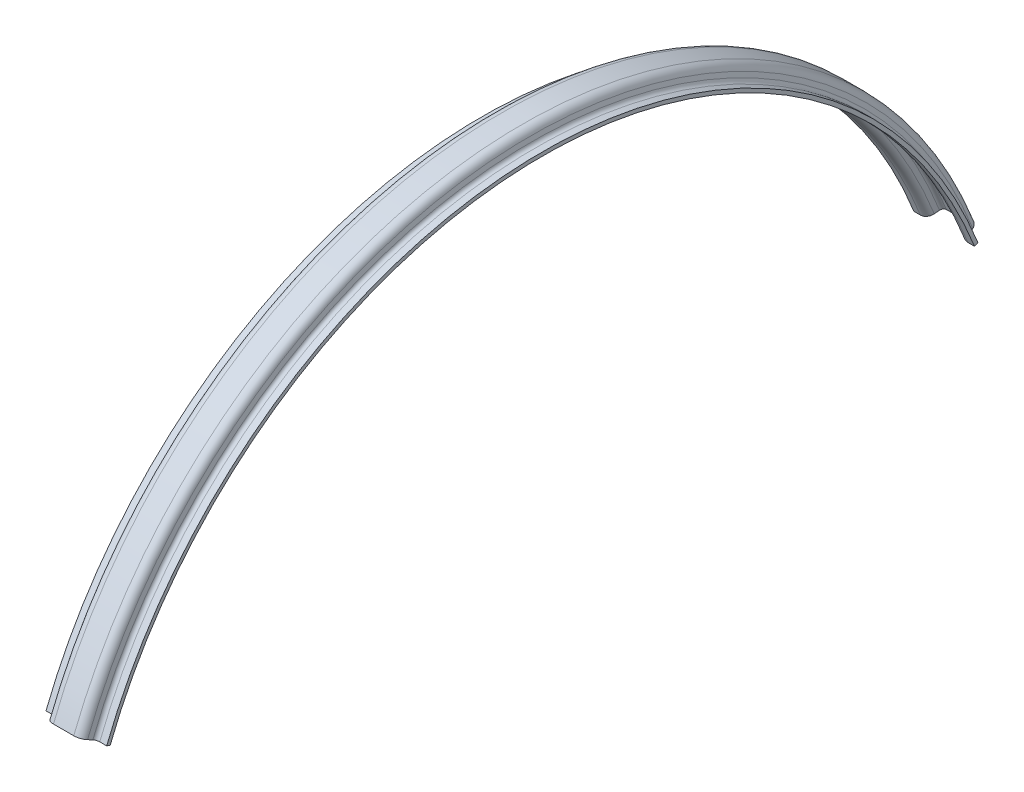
ISO-10303-21;
HEADER;
FILE_DESCRIPTION(('STEP AP214'),'2;1');
FILE_NAME('part.step','',(''),(''),'','','');
FILE_SCHEMA(('AUTOMOTIVE_DESIGN { 1 0 10303 214 1 1 1 1 }'));
ENDSEC;
DATA;
#1=APPLICATION_CONTEXT('core data for automotive mechanical design processes');
#2=APPLICATION_PROTOCOL_DEFINITION('international standard','automotive_design',2000,#1);
#3=PRODUCT_CONTEXT('',#1,'mechanical');
#4=PRODUCT('Part','Part','',(#3));
#5=PRODUCT_RELATED_PRODUCT_CATEGORY('part','',(#4));
#6=PRODUCT_DEFINITION_FORMATION('','',#4);
#7=PRODUCT_DEFINITION_CONTEXT('part definition',#1,'design');
#8=PRODUCT_DEFINITION('design','',#6,#7);
#9=PRODUCT_DEFINITION_SHAPE('','',#8);
#10=(LENGTH_UNIT() NAMED_UNIT(*) SI_UNIT(.MILLI.,.METRE.));
#11=(NAMED_UNIT(*) PLANE_ANGLE_UNIT() SI_UNIT($,.RADIAN.));
#12=(NAMED_UNIT(*) SI_UNIT($,.STERADIAN.) SOLID_ANGLE_UNIT());
#13=UNCERTAINTY_MEASURE_WITH_UNIT(LENGTH_MEASURE(1.E-05),#10,'distance_accuracy_value','');
#14=(GEOMETRIC_REPRESENTATION_CONTEXT(3) GLOBAL_UNCERTAINTY_ASSIGNED_CONTEXT((#13)) GLOBAL_UNIT_ASSIGNED_CONTEXT((#10,
#11,#12)) REPRESENTATION_CONTEXT('',''));
#15=CARTESIAN_POINT('',(0.,0.,0.));
#16=DIRECTION('',(0.,0.,1.));
#17=DIRECTION('',(1.,0.,0.));
#18=AXIS2_PLACEMENT_3D('',#15,#16,#17);
#19=CARTESIAN_POINT('',(16.6370000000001,94.1060068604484,-238.90201628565));
#20=DIRECTION('',(1.,0.,0.));
#21=DIRECTION('',(0.,1.,0.));
#22=AXIS2_PLACEMENT_3D('',#19,#20,#21);
#23=PLANE('',#22);
#24=CARTESIAN_POINT('',(16.6370000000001,0.,0.));
#25=DIRECTION('',(1.,0.,0.));
#26=DIRECTION('',(0.,1.,0.));
#27=AXIS2_PLACEMENT_3D('',#24,#25,#26);
#28=CIRCLE('',#27,254.7366);
#29=CARTESIAN_POINT('',(16.6370000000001,93.3612763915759,-237.01140784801));
#30=VERTEX_POINT('',#29);
#31=CARTESIAN_POINT('',(16.6370000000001,93.361276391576,237.01140784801));
#32=VERTEX_POINT('',#31);
#33=EDGE_CURVE('E11',#30,#32,#28,.T.);
#34=ORIENTED_EDGE('',*,*,#33,.F.);
#35=DIRECTION('',(0.,0.366501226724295,-0.930417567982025));
#36=VECTOR('',#35,1.);
#37=CARTESIAN_POINT('',(16.6370000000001,94.1060068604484,-238.90201628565));
#38=LINE('',#37,#36);
#39=CARTESIAN_POINT('',(16.6370000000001,94.1060068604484,-238.90201628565));
#40=VERTEX_POINT('',#39);
#41=EDGE_CURVE('E169',#30,#40,#38,.T.);
#42=ORIENTED_EDGE('',*,*,#41,.T.);
#43=CARTESIAN_POINT('',(16.6370000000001,0.,0.));
#44=DIRECTION('',(1.,0.,0.));
#45=DIRECTION('',(0.,1.,0.));
#46=AXIS2_PLACEMENT_3D('',#43,#44,#45);
#47=CIRCLE('',#46,256.768599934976);
#48=CARTESIAN_POINT('',(16.6370000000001,94.1060068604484,238.90201628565));
#49=VERTEX_POINT('',#48);
#50=EDGE_CURVE('E164',#40,#49,#47,.T.);
#51=ORIENTED_EDGE('',*,*,#50,.T.);
#52=DIRECTION('',(0.,0.366501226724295,0.930417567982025));
#53=VECTOR('',#52,1.);
#54=CARTESIAN_POINT('',(16.6370000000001,94.1060068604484,238.90201628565));
#55=LINE('',#54,#53);
#56=EDGE_CURVE('E167',#32,#49,#55,.T.);
#57=ORIENTED_EDGE('',*,*,#56,.F.);
#58=EDGE_LOOP('',(#34,#42,#51,#57));
#59=FACE_BOUND('',#58,.T.);
#60=ADVANCED_FACE('F32',(#59),#23,.T.);
#61=CARTESIAN_POINT('',(82.8734907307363,0.,0.));
#62=DIRECTION('',(1.,0.,0.));
#63=DIRECTION('',(0.,1.,0.));
#64=AXIS2_PLACEMENT_3D('',#61,#62,#63);
#65=CYLINDRICAL_SURFACE('',#64,254.7366);
#66=CARTESIAN_POINT('',(13.028468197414,0.,0.));
#67=DIRECTION('',(1.,0.,0.));
#68=DIRECTION('',(0.,1.,0.));
#69=AXIS2_PLACEMENT_3D('',#66,#67,#68);
#70=CIRCLE('',#69,254.7366);
#71=CARTESIAN_POINT('',(13.028468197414,93.3612763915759,-237.01140784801));
#72=VERTEX_POINT('',#71);
#73=CARTESIAN_POINT('',(13.028468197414,93.361276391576,237.01140784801));
#74=VERTEX_POINT('',#73);
#75=EDGE_CURVE('E40',#72,#74,#70,.T.);
#76=ORIENTED_EDGE('',*,*,#75,.F.);
#77=DIRECTION('',(1.,0.,0.));
#78=VECTOR('',#77,1.);
#79=CARTESIAN_POINT('',(13.028468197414,93.3612763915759,-237.01140784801));
#80=LINE('',#79,#78);
#81=EDGE_CURVE('E174',#72,#30,#80,.T.);
#82=ORIENTED_EDGE('',*,*,#81,.T.);
#83=ORIENTED_EDGE('',*,*,#33,.T.);
#84=DIRECTION('',(1.,0.,0.));
#85=VECTOR('',#84,1.);
#86=CARTESIAN_POINT('',(13.028468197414,93.361276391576,237.01140784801));
#87=LINE('',#86,#85);
#88=EDGE_CURVE('E187',#74,#32,#87,.T.);
#89=ORIENTED_EDGE('',*,*,#88,.F.);
#90=EDGE_LOOP('',(#76,#82,#83,#89));
#91=FACE_BOUND('',#90,.T.);
#92=ADVANCED_FACE('F34',(#91),#65,.F.);
#93=CARTESIAN_POINT('',(13.028468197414,0.,0.));
#94=DIRECTION('',(1.,0.,0.));
#95=DIRECTION('',(0.,1.,0.));
#96=AXIS2_PLACEMENT_3D('',#93,#94,#95);
#97=TOROIDAL_SURFACE('',#96,259.3086,4.572);
#98=CARTESIAN_POINT('',(8.61225531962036,0.,0.));
#99=DIRECTION('',(1.,0.,0.));
#100=DIRECTION('',(0.,1.,0.));
#101=AXIS2_PLACEMENT_3D('',#98,#99,#100);
#102=CIRCLE('',#101,258.125279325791);
#103=CARTESIAN_POINT('',(8.61225531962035,94.6032315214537,-240.164294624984));
#104=VERTEX_POINT('',#103);
#105=CARTESIAN_POINT('',(8.61225531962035,94.6032315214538,240.164294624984));
#106=VERTEX_POINT('',#105);
#107=EDGE_CURVE('E324',#104,#106,#102,.T.);
#108=ORIENTED_EDGE('',*,*,#107,.F.);
#109=CARTESIAN_POINT('',(13.028468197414,95.0369200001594,-241.265276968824));
#110=DIRECTION('',(0.,0.930417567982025,0.366501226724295));
#111=DIRECTION('',(-1.,0.,0.));
#112=AXIS2_PLACEMENT_3D('',#109,#110,#111);
#113=CIRCLE('',#112,4.572);
#114=EDGE_CURVE('E290',#104,#72,#113,.T.);
#115=ORIENTED_EDGE('',*,*,#114,.T.);
#116=ORIENTED_EDGE('',*,*,#75,.T.);
#117=CARTESIAN_POINT('',(13.028468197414,95.0369200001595,241.265276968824));
#118=DIRECTION('',(0.,-0.930417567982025,0.366501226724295));
#119=DIRECTION('',(-1.,0.,0.));
#120=AXIS2_PLACEMENT_3D('',#117,#118,#119);
#121=CIRCLE('',#120,4.572);
#122=EDGE_CURVE('E236',#106,#74,#121,.T.);
#123=ORIENTED_EDGE('',*,*,#122,.F.);
#124=EDGE_LOOP('',(#108,#115,#116,#123));
#125=FACE_BOUND('',#124,.T.);
#126=ADVANCED_FACE('F327',(#125),#97,.T.);
#127=CARTESIAN_POINT('',(7.95969694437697,0.,0.));
#128=DIRECTION('',(-1.,0.,0.));
#129=DIRECTION('',(0.,-1.,0.));
#130=AXIS2_PLACEMENT_3D('',#127,#128,#129);
#131=CONICAL_SURFACE('',#130,260.560660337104,1.30899693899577);
#132=CARTESIAN_POINT('',(7.95969694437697,0.,0.));
#133=DIRECTION('',(1.,0.,0.));
#134=DIRECTION('',(0.,1.,0.));
#135=AXIS2_PLACEMENT_3D('',#132,#133,#134);
#136=CIRCLE('',#135,260.560660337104);
#137=CARTESIAN_POINT('',(7.95969694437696,95.495801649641,-242.430215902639));
#138=VERTEX_POINT('',#137);
#139=CARTESIAN_POINT('',(7.95969694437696,95.4958016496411,242.430215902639));
#140=VERTEX_POINT('',#139);
#141=EDGE_CURVE('E322',#138,#140,#136,.T.);
#142=ORIENTED_EDGE('',*,*,#141,.F.);
#143=DIRECTION('',(0.258819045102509,-0.354013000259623,0.898714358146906));
#144=VECTOR('',#143,1.);
#145=CARTESIAN_POINT('',(7.95969694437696,95.495801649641,-242.430215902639));
#146=LINE('',#145,#144);
#147=EDGE_CURVE('E287',#138,#104,#146,.T.);
#148=ORIENTED_EDGE('',*,*,#147,.T.);
#149=ORIENTED_EDGE('',*,*,#107,.T.);
#150=DIRECTION('',(0.258819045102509,-0.354013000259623,-0.898714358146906));
#151=VECTOR('',#150,1.);
#152=CARTESIAN_POINT('',(7.95969694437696,95.4958016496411,242.430215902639));
#153=LINE('',#152,#151);
#154=EDGE_CURVE('E233',#140,#106,#153,.T.);
#155=ORIENTED_EDGE('',*,*,#154,.F.);
#156=EDGE_LOOP('',(#142,#148,#149,#155));
#157=FACE_BOUND('',#156,.T.);
#158=ADVANCED_FACE('F394',(#157),#131,.F.);
#159=CARTESIAN_POINT('',(5.75159050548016,0.,0.));
#160=DIRECTION('',(1.,0.,0.));
#161=DIRECTION('',(0.,1.,0.));
#162=AXIS2_PLACEMENT_3D('',#159,#160,#161);
#163=TOROIDAL_SURFACE('',#162,259.969,2.28600000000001);
#164=CARTESIAN_POINT('',(5.7515905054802,0.,0.));
#165=DIRECTION('',(1.,0.,0.));
#166=DIRECTION('',(0.,1.,0.));
#167=AXIS2_PLACEMENT_3D('',#164,#165,#166);
#168=CIRCLE('',#167,262.255);
#169=CARTESIAN_POINT('',(5.75159050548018,96.1167792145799,-244.006659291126));
#170=VERTEX_POINT('',#169);
#171=CARTESIAN_POINT('',(5.75159050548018,96.1167792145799,244.006659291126));
#172=VERTEX_POINT('',#171);
#173=EDGE_CURVE('E320',#170,#172,#168,.T.);
#174=ORIENTED_EDGE('',*,*,#173,.F.);
#175=CARTESIAN_POINT('',(5.75159050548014,95.2789574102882,-241.879724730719));
#176=DIRECTION('',(0.,-0.930417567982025,-0.366501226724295));
#177=DIRECTION('',(1.,0.,0.));
#178=AXIS2_PLACEMENT_3D('',#175,#176,#177);
#179=CIRCLE('',#178,2.28600000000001);
#180=EDGE_CURVE('E284',#170,#138,#179,.T.);
#181=ORIENTED_EDGE('',*,*,#180,.T.);
#182=ORIENTED_EDGE('',*,*,#141,.T.);
#183=CARTESIAN_POINT('',(5.75159050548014,95.2789574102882,241.879724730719));
#184=DIRECTION('',(0.,0.930417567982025,-0.366501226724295));
#185=DIRECTION('',(1.,0.,0.));
#186=AXIS2_PLACEMENT_3D('',#183,#184,#185);
#187=CIRCLE('',#186,2.28600000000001);
#188=EDGE_CURVE('E230',#172,#140,#187,.T.);
#189=ORIENTED_EDGE('',*,*,#188,.F.);
#190=EDGE_LOOP('',(#174,#181,#182,#189));
#191=FACE_BOUND('',#190,.T.);
#192=ADVANCED_FACE('F391',(#191),#163,.F.);
#193=CARTESIAN_POINT('',(82.8734907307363,0.,0.));
#194=DIRECTION('',(1.,0.,0.));
#195=DIRECTION('',(0.,1.,0.));
#196=AXIS2_PLACEMENT_3D('',#193,#194,#195);
#197=CYLINDRICAL_SURFACE('',#196,262.255);
#198=CARTESIAN_POINT('',(-5.75159050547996,0.,0.));
#199=DIRECTION('',(1.,0.,0.));
#200=DIRECTION('',(0.,1.,0.));
#201=AXIS2_PLACEMENT_3D('',#198,#199,#200);
#202=CIRCLE('',#201,262.255);
#203=CARTESIAN_POINT('',(-5.75159050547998,96.1167792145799,-244.006659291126));
#204=VERTEX_POINT('',#203);
#205=CARTESIAN_POINT('',(-5.75159050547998,96.1167792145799,244.006659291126));
#206=VERTEX_POINT('',#205);
#207=EDGE_CURVE('E318',#204,#206,#202,.T.);
#208=ORIENTED_EDGE('',*,*,#207,.F.);
#209=DIRECTION('',(1.,0.,0.));
#210=VECTOR('',#209,1.);
#211=CARTESIAN_POINT('',(-5.75159050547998,96.1167792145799,-244.006659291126));
#212=LINE('',#211,#210);
#213=EDGE_CURVE('E281',#204,#170,#212,.T.);
#214=ORIENTED_EDGE('',*,*,#213,.T.);
#215=ORIENTED_EDGE('',*,*,#173,.T.);
#216=DIRECTION('',(1.,0.,0.));
#217=VECTOR('',#216,1.);
#218=CARTESIAN_POINT('',(-5.75159050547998,96.1167792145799,244.006659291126));
#219=LINE('',#218,#217);
#220=EDGE_CURVE('E227',#206,#172,#219,.T.);
#221=ORIENTED_EDGE('',*,*,#220,.F.);
#222=EDGE_LOOP('',(#208,#214,#215,#221));
#223=FACE_BOUND('',#222,.T.);
#224=ADVANCED_FACE('F388',(#223),#197,.F.);
#225=CARTESIAN_POINT('',(-5.75159050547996,0.,0.));
#226=DIRECTION('',(1.,0.,0.));
#227=DIRECTION('',(0.,1.,0.));
#228=AXIS2_PLACEMENT_3D('',#225,#226,#227);
#229=TOROIDAL_SURFACE('',#228,259.969,2.28600000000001);
#230=CARTESIAN_POINT('',(-7.95969694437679,0.,0.));
#231=DIRECTION('',(1.,0.,0.));
#232=DIRECTION('',(0.,1.,0.));
#233=AXIS2_PLACEMENT_3D('',#230,#231,#232);
#234=CIRCLE('',#233,260.560660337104);
#235=CARTESIAN_POINT('',(-7.9596969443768,95.495801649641,-242.430215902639));
#236=VERTEX_POINT('',#235);
#237=CARTESIAN_POINT('',(-7.9596969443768,95.4958016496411,242.430215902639));
#238=VERTEX_POINT('',#237);
#239=EDGE_CURVE('E316',#236,#238,#234,.T.);
#240=ORIENTED_EDGE('',*,*,#239,.F.);
#241=CARTESIAN_POINT('',(-5.75159050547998,95.2789574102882,-241.879724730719));
#242=DIRECTION('',(0.,-0.930417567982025,-0.366501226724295));
#243=DIRECTION('',(1.,0.,0.));
#244=AXIS2_PLACEMENT_3D('',#241,#242,#243);
#245=CIRCLE('',#244,2.28600000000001);
#246=EDGE_CURVE('E278',#236,#204,#245,.T.);
#247=ORIENTED_EDGE('',*,*,#246,.T.);
#248=ORIENTED_EDGE('',*,*,#207,.T.);
#249=CARTESIAN_POINT('',(-5.75159050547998,95.2789574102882,241.879724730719));
#250=DIRECTION('',(0.,0.930417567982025,-0.366501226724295));
#251=DIRECTION('',(1.,0.,0.));
#252=AXIS2_PLACEMENT_3D('',#249,#250,#251);
#253=CIRCLE('',#252,2.28600000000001);
#254=EDGE_CURVE('E224',#238,#206,#253,.T.);
#255=ORIENTED_EDGE('',*,*,#254,.F.);
#256=EDGE_LOOP('',(#240,#247,#248,#255));
#257=FACE_BOUND('',#256,.T.);
#258=ADVANCED_FACE('F383',(#257),#229,.F.);
#259=CARTESIAN_POINT('',(-8.61225531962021,0.,0.));
#260=DIRECTION('',(1.,0.,0.));
#261=DIRECTION('',(0.,1.,0.));
#262=AXIS2_PLACEMENT_3D('',#259,#260,#261);
#263=CONICAL_SURFACE('',#262,258.125279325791,1.30899693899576);
#264=CARTESIAN_POINT('',(-8.61225531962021,0.,0.));
#265=DIRECTION('',(1.,0.,0.));
#266=DIRECTION('',(0.,1.,0.));
#267=AXIS2_PLACEMENT_3D('',#264,#265,#266);
#268=CIRCLE('',#267,258.125279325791);
#269=CARTESIAN_POINT('',(-8.61225531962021,94.6032315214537,-240.164294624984));
#270=VERTEX_POINT('',#269);
#271=CARTESIAN_POINT('',(-8.61225531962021,94.6032315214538,240.164294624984));
#272=VERTEX_POINT('',#271);
#273=EDGE_CURVE('E314',#270,#272,#268,.T.);
#274=ORIENTED_EDGE('',*,*,#273,.F.);
#275=DIRECTION('',(0.258819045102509,0.354013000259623,-0.898714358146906));
#276=VECTOR('',#275,1.);
#277=CARTESIAN_POINT('',(-7.9596969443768,95.495801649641,-242.430215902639));
#278=LINE('',#277,#276);
#279=EDGE_CURVE('E275',#270,#236,#278,.T.);
#280=ORIENTED_EDGE('',*,*,#279,.T.);
#281=ORIENTED_EDGE('',*,*,#239,.T.);
#282=DIRECTION('',(0.258819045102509,0.354013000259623,0.898714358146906));
#283=VECTOR('',#282,1.);
#284=CARTESIAN_POINT('',(-7.9596969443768,95.4958016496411,242.430215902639));
#285=LINE('',#284,#283);
#286=EDGE_CURVE('E221',#272,#238,#285,.T.);
#287=ORIENTED_EDGE('',*,*,#286,.F.);
#288=EDGE_LOOP('',(#274,#280,#281,#287));
#289=FACE_BOUND('',#288,.T.);
#290=ADVANCED_FACE('F380',(#289),#263,.F.);
#291=CARTESIAN_POINT('',(-13.0284681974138,0.,0.));
#292=DIRECTION('',(1.,0.,0.));
#293=DIRECTION('',(0.,1.,0.));
#294=AXIS2_PLACEMENT_3D('',#291,#292,#293);
#295=TOROIDAL_SURFACE('',#294,259.3086,4.572);
#296=CARTESIAN_POINT('',(-13.0284681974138,0.,0.));
#297=DIRECTION('',(1.,0.,0.));
#298=DIRECTION('',(0.,1.,0.));
#299=AXIS2_PLACEMENT_3D('',#296,#297,#298);
#300=CIRCLE('',#299,254.7366);
#301=CARTESIAN_POINT('',(-13.0284681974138,93.3612763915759,-237.01140784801));
#302=VERTEX_POINT('',#301);
#303=CARTESIAN_POINT('',(-13.0284681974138,93.361276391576,237.01140784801));
#304=VERTEX_POINT('',#303);
#305=EDGE_CURVE('E312',#302,#304,#300,.T.);
#306=ORIENTED_EDGE('',*,*,#305,.F.);
#307=CARTESIAN_POINT('',(-13.0284681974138,95.0369200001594,-241.265276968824));
#308=DIRECTION('',(0.,0.930417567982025,0.366501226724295));
#309=DIRECTION('',(1.,0.,0.));
#310=AXIS2_PLACEMENT_3D('',#307,#308,#309);
#311=CIRCLE('',#310,4.572);
#312=EDGE_CURVE('E272',#302,#270,#311,.T.);
#313=ORIENTED_EDGE('',*,*,#312,.T.);
#314=ORIENTED_EDGE('',*,*,#273,.T.);
#315=CARTESIAN_POINT('',(-13.0284681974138,95.0369200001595,241.265276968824));
#316=DIRECTION('',(0.,-0.930417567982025,0.366501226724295));
#317=DIRECTION('',(1.,0.,0.));
#318=AXIS2_PLACEMENT_3D('',#315,#316,#317);
#319=CIRCLE('',#318,4.572);
#320=EDGE_CURVE('E218',#304,#272,#319,.T.);
#321=ORIENTED_EDGE('',*,*,#320,.F.);
#322=EDGE_LOOP('',(#306,#313,#314,#321));
#323=FACE_BOUND('',#322,.T.);
#324=ADVANCED_FACE('F375',(#323),#295,.T.);
#325=CARTESIAN_POINT('',(82.8734907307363,0.,0.));
#326=DIRECTION('',(1.,0.,0.));
#327=DIRECTION('',(0.,1.,0.));
#328=AXIS2_PLACEMENT_3D('',#325,#326,#327);
#329=CYLINDRICAL_SURFACE('',#328,254.7366);
#330=CARTESIAN_POINT('',(-16.6369999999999,0.,0.));
#331=DIRECTION('',(1.,0.,0.));
#332=DIRECTION('',(0.,1.,0.));
#333=AXIS2_PLACEMENT_3D('',#330,#331,#332);
#334=CIRCLE('',#333,254.7366);
#335=CARTESIAN_POINT('',(-16.6369999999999,93.3612763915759,-237.01140784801));
#336=VERTEX_POINT('',#335);
#337=CARTESIAN_POINT('',(-16.6369999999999,93.361276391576,237.01140784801));
#338=VERTEX_POINT('',#337);
#339=EDGE_CURVE('E310',#336,#338,#334,.T.);
#340=ORIENTED_EDGE('',*,*,#339,.F.);
#341=DIRECTION('',(1.,0.,0.));
#342=VECTOR('',#341,1.);
#343=CARTESIAN_POINT('',(-13.0284681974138,93.3612763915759,-237.01140784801));
#344=LINE('',#343,#342);
#345=EDGE_CURVE('E269',#336,#302,#344,.T.);
#346=ORIENTED_EDGE('',*,*,#345,.T.);
#347=ORIENTED_EDGE('',*,*,#305,.T.);
#348=DIRECTION('',(1.,0.,0.));
#349=VECTOR('',#348,1.);
#350=CARTESIAN_POINT('',(-13.0284681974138,93.361276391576,237.01140784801));
#351=LINE('',#350,#349);
#352=EDGE_CURVE('E215',#338,#304,#351,.T.);
#353=ORIENTED_EDGE('',*,*,#352,.F.);
#354=EDGE_LOOP('',(#340,#346,#347,#353));
#355=FACE_BOUND('',#354,.T.);
#356=ADVANCED_FACE('F372',(#355),#329,.F.);
#357=CARTESIAN_POINT('',(-16.6369999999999,94.1060068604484,-238.90201628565));
#358=DIRECTION('',(-1.,0.,0.));
#359=DIRECTION('',(0.,-1.,0.));
#360=AXIS2_PLACEMENT_3D('',#357,#358,#359);
#361=PLANE('',#360);
#362=CARTESIAN_POINT('',(-16.6369999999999,0.,0.));
#363=DIRECTION('',(1.,0.,0.));
#364=DIRECTION('',(0.,1.,0.));
#365=AXIS2_PLACEMENT_3D('',#362,#363,#364);
#366=CIRCLE('',#365,256.768599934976);
#367=CARTESIAN_POINT('',(-16.6369999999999,94.1060068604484,-238.90201628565));
#368=VERTEX_POINT('',#367);
#369=CARTESIAN_POINT('',(-16.6369999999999,94.1060068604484,238.90201628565));
#370=VERTEX_POINT('',#369);
#371=EDGE_CURVE('E308',#368,#370,#366,.T.);
#372=ORIENTED_EDGE('',*,*,#371,.F.);
#373=DIRECTION('',(0.,-0.366501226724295,0.930417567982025));
#374=VECTOR('',#373,1.);
#375=CARTESIAN_POINT('',(-16.6369999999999,94.1060068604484,-238.90201628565));
#376=LINE('',#375,#374);
#377=EDGE_CURVE('E266',#368,#336,#376,.T.);
#378=ORIENTED_EDGE('',*,*,#377,.T.);
#379=ORIENTED_EDGE('',*,*,#339,.T.);
#380=DIRECTION('',(0.,-0.366501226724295,-0.930417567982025));
#381=VECTOR('',#380,1.);
#382=CARTESIAN_POINT('',(-16.6369999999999,94.1060068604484,238.90201628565));
#383=LINE('',#382,#381);
#384=EDGE_CURVE('E212',#370,#338,#383,.T.);
#385=ORIENTED_EDGE('',*,*,#384,.F.);
#386=EDGE_LOOP('',(#372,#378,#379,#385));
#387=FACE_BOUND('',#386,.T.);
#388=ADVANCED_FACE('F367',(#387),#361,.T.);
#389=CARTESIAN_POINT('',(82.8734907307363,0.,0.));
#390=DIRECTION('',(1.,0.,0.));
#391=DIRECTION('',(0.,1.,0.));
#392=AXIS2_PLACEMENT_3D('',#389,#390,#391);
#393=CYLINDRICAL_SURFACE('',#392,256.768599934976);
#394=CARTESIAN_POINT('',(-12.8335670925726,0.,0.));
#395=DIRECTION('',(1.,0.,0.));
#396=DIRECTION('',(0.,1.,0.));
#397=AXIS2_PLACEMENT_3D('',#394,#395,#396);
#398=CIRCLE('',#397,256.768599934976);
#399=CARTESIAN_POINT('',(-12.8335670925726,94.1060068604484,-238.90201628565));
#400=VERTEX_POINT('',#399);
#401=CARTESIAN_POINT('',(-12.8335670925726,94.1060068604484,238.90201628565));
#402=VERTEX_POINT('',#401);
#403=EDGE_CURVE('E306',#400,#402,#398,.T.);
#404=ORIENTED_EDGE('',*,*,#403,.F.);
#405=DIRECTION('',(-1.,0.,0.));
#406=VECTOR('',#405,1.);
#407=CARTESIAN_POINT('',(-12.8335670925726,94.1060068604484,-238.90201628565));
#408=LINE('',#407,#406);
#409=EDGE_CURVE('E263',#400,#368,#408,.T.);
#410=ORIENTED_EDGE('',*,*,#409,.T.);
#411=ORIENTED_EDGE('',*,*,#371,.T.);
#412=DIRECTION('',(-1.,0.,0.));
#413=VECTOR('',#412,1.);
#414=CARTESIAN_POINT('',(-12.8335670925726,94.1060068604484,238.90201628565));
#415=LINE('',#414,#413);
#416=EDGE_CURVE('E209',#402,#370,#415,.T.);
#417=ORIENTED_EDGE('',*,*,#416,.F.);
#418=EDGE_LOOP('',(#404,#410,#411,#417));
#419=FACE_BOUND('',#418,.T.);
#420=ADVANCED_FACE('F364',(#419),#393,.T.);
#421=CARTESIAN_POINT('',(-12.8335670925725,0.,0.));
#422=DIRECTION('',(1.,0.,0.));
#423=DIRECTION('',(0.,1.,0.));
#424=AXIS2_PLACEMENT_3D('',#421,#422,#423);
#425=TOROIDAL_SURFACE('',#424,259.054599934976,2.28599999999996);
#426=CARTESIAN_POINT('',(-10.6254606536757,0.,0.));
#427=DIRECTION('',(1.,0.,0.));
#428=DIRECTION('',(0.,1.,0.));
#429=AXIS2_PLACEMENT_3D('',#426,#427,#428);
#430=CIRCLE('',#429,258.462939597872);
#431=CARTESIAN_POINT('',(-10.6254606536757,94.7269844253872,-240.478459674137));
#432=VERTEX_POINT('',#431);
#433=CARTESIAN_POINT('',(-10.6254606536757,94.7269844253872,240.478459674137));
#434=VERTEX_POINT('',#433);
#435=EDGE_CURVE('E304',#432,#434,#430,.T.);
#436=ORIENTED_EDGE('',*,*,#435,.F.);
#437=CARTESIAN_POINT('',(-12.8335670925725,94.9438286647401,-241.028950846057));
#438=DIRECTION('',(0.,-0.930417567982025,-0.366501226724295));
#439=DIRECTION('',(1.,0.,0.));
#440=AXIS2_PLACEMENT_3D('',#437,#438,#439);
#441=CIRCLE('',#440,2.28599999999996);
#442=EDGE_CURVE('E260',#432,#400,#441,.T.);
#443=ORIENTED_EDGE('',*,*,#442,.T.);
#444=ORIENTED_EDGE('',*,*,#403,.T.);
#445=CARTESIAN_POINT('',(-12.8335670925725,94.9438286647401,241.028950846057));
#446=DIRECTION('',(0.,0.930417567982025,-0.366501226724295));
#447=DIRECTION('',(1.,0.,0.));
#448=AXIS2_PLACEMENT_3D('',#445,#446,#447);
#449=CIRCLE('',#448,2.28599999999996);
#450=EDGE_CURVE('E206',#434,#402,#449,.T.);
#451=ORIENTED_EDGE('',*,*,#450,.F.);
#452=EDGE_LOOP('',(#436,#443,#444,#451));
#453=FACE_BOUND('',#452,.T.);
#454=ADVANCED_FACE('F359',(#453),#425,.F.);
#455=CARTESIAN_POINT('',(-9.97290227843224,0.,0.));
#456=DIRECTION('',(1.,0.,0.));
#457=DIRECTION('',(0.,1.,0.));
#458=AXIS2_PLACEMENT_3D('',#455,#456,#457);
#459=CONICAL_SURFACE('',#458,260.898320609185,1.30899693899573);
#460=CARTESIAN_POINT('',(-9.97290227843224,0.,0.));
#461=DIRECTION('',(1.,0.,0.));
#462=DIRECTION('',(0.,1.,0.));
#463=AXIS2_PLACEMENT_3D('',#460,#461,#462);
#464=CIRCLE('',#463,260.898320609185);
#465=CARTESIAN_POINT('',(-9.97290227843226,95.6195545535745,-242.744380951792));
#466=VERTEX_POINT('',#465);
#467=CARTESIAN_POINT('',(-9.97290227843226,95.6195545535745,242.744380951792));
#468=VERTEX_POINT('',#467);
#469=EDGE_CURVE('E302',#466,#468,#464,.T.);
#470=ORIENTED_EDGE('',*,*,#469,.F.);
#471=DIRECTION('',(-0.258819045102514,-0.354013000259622,0.898714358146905));
#472=VECTOR('',#471,1.);
#473=CARTESIAN_POINT('',(-9.97290227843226,95.6195545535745,-242.744380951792));
#474=LINE('',#473,#472);
#475=EDGE_CURVE('E257',#466,#432,#474,.T.);
#476=ORIENTED_EDGE('',*,*,#475,.T.);
#477=ORIENTED_EDGE('',*,*,#435,.T.);
#478=DIRECTION('',(-0.258819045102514,-0.354013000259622,-0.898714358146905));
#479=VECTOR('',#478,1.);
#480=CARTESIAN_POINT('',(-9.97290227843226,95.6195545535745,242.744380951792));
#481=LINE('',#480,#479);
#482=EDGE_CURVE('E203',#468,#434,#481,.T.);
#483=ORIENTED_EDGE('',*,*,#482,.F.);
#484=EDGE_LOOP('',(#470,#476,#477,#483));
#485=FACE_BOUND('',#484,.T.);
#486=ADVANCED_FACE('F356',(#485),#459,.T.);
#487=CARTESIAN_POINT('',(-5.55668940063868,0.,0.));
#488=DIRECTION('',(1.,0.,0.));
#489=DIRECTION('',(0.,1.,0.));
#490=AXIS2_PLACEMENT_3D('',#487,#488,#489);
#491=TOROIDAL_SURFACE('',#490,259.714999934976,4.57199999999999);
#492=CARTESIAN_POINT('',(-5.55668940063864,0.,0.));
#493=DIRECTION('',(1.,0.,0.));
#494=DIRECTION('',(0.,1.,0.));
#495=AXIS2_PLACEMENT_3D('',#492,#493,#494);
#496=CIRCLE('',#495,264.286999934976);
#497=CARTESIAN_POINT('',(-5.55668940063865,96.8615096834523,-245.897267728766));
#498=VERTEX_POINT('',#497);
#499=CARTESIAN_POINT('',(-5.55668940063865,96.8615096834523,245.897267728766));
#500=VERTEX_POINT('',#499);
#501=EDGE_CURVE('E300',#498,#500,#496,.T.);
#502=ORIENTED_EDGE('',*,*,#501,.F.);
#503=CARTESIAN_POINT('',(-5.55668940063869,95.1858660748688,-241.643398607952));
#504=DIRECTION('',(0.,0.930417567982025,0.366501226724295));
#505=DIRECTION('',(-1.,0.,0.));
#506=AXIS2_PLACEMENT_3D('',#503,#504,#505);
#507=CIRCLE('',#506,4.57199999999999);
#508=EDGE_CURVE('E254',#498,#466,#507,.T.);
#509=ORIENTED_EDGE('',*,*,#508,.T.);
#510=ORIENTED_EDGE('',*,*,#469,.T.);
#511=CARTESIAN_POINT('',(-5.55668940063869,95.1858660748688,241.643398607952));
#512=DIRECTION('',(0.,-0.930417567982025,0.366501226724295));
#513=DIRECTION('',(-1.,0.,0.));
#514=AXIS2_PLACEMENT_3D('',#511,#512,#513);
#515=CIRCLE('',#514,4.57199999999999);
#516=EDGE_CURVE('E200',#500,#468,#515,.T.);
#517=ORIENTED_EDGE('',*,*,#516,.F.);
#518=EDGE_LOOP('',(#502,#509,#510,#517));
#519=FACE_BOUND('',#518,.T.);
#520=ADVANCED_FACE('F351',(#519),#491,.T.);
#521=CARTESIAN_POINT('',(82.8734907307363,0.,0.));
#522=DIRECTION('',(1.,0.,0.));
#523=DIRECTION('',(0.,1.,0.));
#524=AXIS2_PLACEMENT_3D('',#521,#522,#523);
#525=CYLINDRICAL_SURFACE('',#524,264.286999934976);
#526=CARTESIAN_POINT('',(5.55668940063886,0.,0.));
#527=DIRECTION('',(1.,0.,0.));
#528=DIRECTION('',(0.,1.,0.));
#529=AXIS2_PLACEMENT_3D('',#526,#527,#528);
#530=CIRCLE('',#529,264.286999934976);
#531=CARTESIAN_POINT('',(5.55668940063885,96.8615096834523,-245.897267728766));
#532=VERTEX_POINT('',#531);
#533=CARTESIAN_POINT('',(5.55668940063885,96.8615096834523,245.897267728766));
#534=VERTEX_POINT('',#533);
#535=EDGE_CURVE('E298',#532,#534,#530,.T.);
#536=ORIENTED_EDGE('',*,*,#535,.F.);
#537=DIRECTION('',(-1.,0.,0.));
#538=VECTOR('',#537,1.);
#539=CARTESIAN_POINT('',(-5.55668940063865,96.8615096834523,-245.897267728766));
#540=LINE('',#539,#538);
#541=EDGE_CURVE('E251',#532,#498,#540,.T.);
#542=ORIENTED_EDGE('',*,*,#541,.T.);
#543=ORIENTED_EDGE('',*,*,#501,.T.);
#544=DIRECTION('',(-1.,0.,0.));
#545=VECTOR('',#544,1.);
#546=CARTESIAN_POINT('',(-5.55668940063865,96.8615096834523,245.897267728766));
#547=LINE('',#546,#545);
#548=EDGE_CURVE('E197',#534,#500,#547,.T.);
#549=ORIENTED_EDGE('',*,*,#548,.F.);
#550=EDGE_LOOP('',(#536,#542,#543,#549));
#551=FACE_BOUND('',#550,.T.);
#552=ADVANCED_FACE('F348',(#551),#525,.T.);
#553=CARTESIAN_POINT('',(5.55668940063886,0.,0.));
#554=DIRECTION('',(1.,0.,0.));
#555=DIRECTION('',(0.,1.,0.));
#556=AXIS2_PLACEMENT_3D('',#553,#554,#555);
#557=TOROIDAL_SURFACE('',#556,259.714999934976,4.57199999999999);
#558=CARTESIAN_POINT('',(9.97290227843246,0.,0.));
#559=DIRECTION('',(1.,0.,0.));
#560=DIRECTION('',(0.,1.,0.));
#561=AXIS2_PLACEMENT_3D('',#558,#559,#560);
#562=CIRCLE('',#561,260.898320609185);
#563=CARTESIAN_POINT('',(9.97290227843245,95.6195545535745,-242.744380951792));
#564=VERTEX_POINT('',#563);
#565=CARTESIAN_POINT('',(9.97290227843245,95.6195545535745,242.744380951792));
#566=VERTEX_POINT('',#565);
#567=EDGE_CURVE('E296',#564,#566,#562,.T.);
#568=ORIENTED_EDGE('',*,*,#567,.F.);
#569=CARTESIAN_POINT('',(5.55668940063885,95.1858660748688,-241.643398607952));
#570=DIRECTION('',(0.,0.930417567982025,0.366501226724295));
#571=DIRECTION('',(1.,0.,0.));
#572=AXIS2_PLACEMENT_3D('',#569,#570,#571);
#573=CIRCLE('',#572,4.57199999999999);
#574=EDGE_CURVE('E248',#564,#532,#573,.T.);
#575=ORIENTED_EDGE('',*,*,#574,.T.);
#576=ORIENTED_EDGE('',*,*,#535,.T.);
#577=CARTESIAN_POINT('',(5.55668940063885,95.1858660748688,241.643398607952));
#578=DIRECTION('',(0.,-0.930417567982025,0.366501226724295));
#579=DIRECTION('',(1.,0.,0.));
#580=AXIS2_PLACEMENT_3D('',#577,#578,#579);
#581=CIRCLE('',#580,4.57199999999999);
#582=EDGE_CURVE('E194',#566,#534,#581,.T.);
#583=ORIENTED_EDGE('',*,*,#582,.F.);
#584=EDGE_LOOP('',(#568,#575,#576,#583));
#585=FACE_BOUND('',#584,.T.);
#586=ADVANCED_FACE('F343',(#585),#557,.T.);
#587=CARTESIAN_POINT('',(10.6254606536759,0.,0.));
#588=DIRECTION('',(-1.,0.,0.));
#589=DIRECTION('',(0.,-1.,0.));
#590=AXIS2_PLACEMENT_3D('',#587,#588,#589);
#591=CONICAL_SURFACE('',#590,258.462939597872,1.30899693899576);
#592=CARTESIAN_POINT('',(10.6254606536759,0.,0.));
#593=DIRECTION('',(1.,0.,0.));
#594=DIRECTION('',(0.,1.,0.));
#595=AXIS2_PLACEMENT_3D('',#592,#593,#594);
#596=CIRCLE('',#595,258.462939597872);
#597=CARTESIAN_POINT('',(10.6254606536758,94.7269844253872,-240.478459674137));
#598=VERTEX_POINT('',#597);
#599=CARTESIAN_POINT('',(10.6254606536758,94.7269844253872,240.478459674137));
#600=VERTEX_POINT('',#599);
#601=EDGE_CURVE('E294',#598,#600,#596,.T.);
#602=ORIENTED_EDGE('',*,*,#601,.F.);
#603=DIRECTION('',(-0.258819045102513,0.354013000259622,-0.898714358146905));
#604=VECTOR('',#603,1.);
#605=CARTESIAN_POINT('',(9.97290227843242,95.6195545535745,-242.744380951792));
#606=LINE('',#605,#604);
#607=EDGE_CURVE('E245',#598,#564,#606,.T.);
#608=ORIENTED_EDGE('',*,*,#607,.T.);
#609=ORIENTED_EDGE('',*,*,#567,.T.);
#610=DIRECTION('',(-0.258819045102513,0.354013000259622,0.898714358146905));
#611=VECTOR('',#610,1.);
#612=CARTESIAN_POINT('',(9.97290227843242,95.6195545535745,242.744380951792));
#613=LINE('',#612,#611);
#614=EDGE_CURVE('E191',#600,#566,#613,.T.);
#615=ORIENTED_EDGE('',*,*,#614,.F.);
#616=EDGE_LOOP('',(#602,#608,#609,#615));
#617=FACE_BOUND('',#616,.T.);
#618=ADVANCED_FACE('F341',(#617),#591,.T.);
#619=CARTESIAN_POINT('',(12.8335670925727,0.,0.));
#620=DIRECTION('',(1.,0.,0.));
#621=DIRECTION('',(0.,1.,0.));
#622=AXIS2_PLACEMENT_3D('',#619,#620,#621);
#623=TOROIDAL_SURFACE('',#622,259.054599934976,2.28600000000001);
#624=CARTESIAN_POINT('',(12.8335670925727,0.,0.));
#625=DIRECTION('',(1.,0.,0.));
#626=DIRECTION('',(0.,1.,0.));
#627=AXIS2_PLACEMENT_3D('',#624,#625,#626);
#628=CIRCLE('',#627,256.768599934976);
#629=CARTESIAN_POINT('',(12.8335670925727,94.1060068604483,-238.90201628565));
#630=VERTEX_POINT('',#629);
#631=CARTESIAN_POINT('',(12.8335670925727,94.1060068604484,238.90201628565));
#632=VERTEX_POINT('',#631);
#633=EDGE_CURVE('E173',#630,#632,#628,.T.);
#634=ORIENTED_EDGE('',*,*,#633,.F.);
#635=CARTESIAN_POINT('',(12.8335670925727,94.9438286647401,-241.028950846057));
#636=DIRECTION('',(0.,-0.930417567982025,-0.366501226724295));
#637=DIRECTION('',(-1.,0.,0.));
#638=AXIS2_PLACEMENT_3D('',#635,#636,#637);
#639=CIRCLE('',#638,2.28600000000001);
#640=EDGE_CURVE('E242',#630,#598,#639,.T.);
#641=ORIENTED_EDGE('',*,*,#640,.T.);
#642=ORIENTED_EDGE('',*,*,#601,.T.);
#643=CARTESIAN_POINT('',(12.8335670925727,94.9438286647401,241.028950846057));
#644=DIRECTION('',(0.,0.930417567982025,-0.366501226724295));
#645=DIRECTION('',(-1.,0.,0.));
#646=AXIS2_PLACEMENT_3D('',#643,#644,#645);
#647=CIRCLE('',#646,2.28600000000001);
#648=EDGE_CURVE('E182',#632,#600,#647,.T.);
#649=ORIENTED_EDGE('',*,*,#648,.F.);
#650=EDGE_LOOP('',(#634,#641,#642,#649));
#651=FACE_BOUND('',#650,.T.);
#652=ADVANCED_FACE('F337',(#651),#623,.F.);
#653=CARTESIAN_POINT('',(82.8734907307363,0.,0.));
#654=DIRECTION('',(1.,0.,0.));
#655=DIRECTION('',(0.,1.,0.));
#656=AXIS2_PLACEMENT_3D('',#653,#654,#655);
#657=CYLINDRICAL_SURFACE('',#656,256.768599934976);
#658=DIRECTION('',(-1.,0.,0.));
#659=VECTOR('',#658,1.);
#660=CARTESIAN_POINT('',(12.8335670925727,94.1060068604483,-238.90201628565));
#661=LINE('',#660,#659);
#662=EDGE_CURVE('E240',#40,#630,#661,.T.);
#663=ORIENTED_EDGE('',*,*,#662,.T.);
#664=ORIENTED_EDGE('',*,*,#633,.T.);
#665=DIRECTION('',(-1.,0.,0.));
#666=VECTOR('',#665,1.);
#667=CARTESIAN_POINT('',(12.8335670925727,94.1060068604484,238.90201628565));
#668=LINE('',#667,#666);
#669=EDGE_CURVE('E177',#49,#632,#668,.T.);
#670=ORIENTED_EDGE('',*,*,#669,.F.);
#671=ORIENTED_EDGE('',*,*,#50,.F.);
#672=EDGE_LOOP('',(#663,#664,#670,#671));
#673=FACE_BOUND('',#672,.T.);
#674=ADVANCED_FACE('F178',(#673),#657,.T.);
#675=CARTESIAN_POINT('',(13.028468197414,95.0369200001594,-241.265276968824));
#676=DIRECTION('',(0.,-0.930417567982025,-0.366501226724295));
#677=DIRECTION('',(-1.,0.,0.));
#678=AXIS2_PLACEMENT_3D('',#675,#676,#677);
#679=PLANE('',#678);
#680=ORIENTED_EDGE('',*,*,#41,.F.);
#681=ORIENTED_EDGE('',*,*,#81,.F.);
#682=ORIENTED_EDGE('',*,*,#114,.F.);
#683=ORIENTED_EDGE('',*,*,#147,.F.);
#684=ORIENTED_EDGE('',*,*,#180,.F.);
#685=ORIENTED_EDGE('',*,*,#213,.F.);
#686=ORIENTED_EDGE('',*,*,#246,.F.);
#687=ORIENTED_EDGE('',*,*,#279,.F.);
#688=ORIENTED_EDGE('',*,*,#312,.F.);
#689=ORIENTED_EDGE('',*,*,#345,.F.);
#690=ORIENTED_EDGE('',*,*,#377,.F.);
#691=ORIENTED_EDGE('',*,*,#409,.F.);
#692=ORIENTED_EDGE('',*,*,#442,.F.);
#693=ORIENTED_EDGE('',*,*,#475,.F.);
#694=ORIENTED_EDGE('',*,*,#508,.F.);
#695=ORIENTED_EDGE('',*,*,#541,.F.);
#696=ORIENTED_EDGE('',*,*,#574,.F.);
#697=ORIENTED_EDGE('',*,*,#607,.F.);
#698=ORIENTED_EDGE('',*,*,#640,.F.);
#699=ORIENTED_EDGE('',*,*,#662,.F.);
#700=EDGE_LOOP('',(#680,#681,#682,#683,#684,#685,#686,#687,#688,#689,#690,#691,#692,#693,#694,
#695,#696,#697,#698,#699));
#701=FACE_BOUND('',#700,.T.);
#702=ADVANCED_FACE('F332',(#701),#679,.T.);
#703=CARTESIAN_POINT('',(13.028468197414,95.0369200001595,241.265276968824));
#704=DIRECTION('',(0.,0.930417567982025,-0.366501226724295));
#705=DIRECTION('',(-1.,0.,0.));
#706=AXIS2_PLACEMENT_3D('',#703,#704,#705);
#707=PLANE('',#706);
#708=ORIENTED_EDGE('',*,*,#56,.T.);
#709=ORIENTED_EDGE('',*,*,#669,.T.);
#710=ORIENTED_EDGE('',*,*,#648,.T.);
#711=ORIENTED_EDGE('',*,*,#614,.T.);
#712=ORIENTED_EDGE('',*,*,#582,.T.);
#713=ORIENTED_EDGE('',*,*,#548,.T.);
#714=ORIENTED_EDGE('',*,*,#516,.T.);
#715=ORIENTED_EDGE('',*,*,#482,.T.);
#716=ORIENTED_EDGE('',*,*,#450,.T.);
#717=ORIENTED_EDGE('',*,*,#416,.T.);
#718=ORIENTED_EDGE('',*,*,#384,.T.);
#719=ORIENTED_EDGE('',*,*,#352,.T.);
#720=ORIENTED_EDGE('',*,*,#320,.T.);
#721=ORIENTED_EDGE('',*,*,#286,.T.);
#722=ORIENTED_EDGE('',*,*,#254,.T.);
#723=ORIENTED_EDGE('',*,*,#220,.T.);
#724=ORIENTED_EDGE('',*,*,#188,.T.);
#725=ORIENTED_EDGE('',*,*,#154,.T.);
#726=ORIENTED_EDGE('',*,*,#122,.T.);
#727=ORIENTED_EDGE('',*,*,#88,.T.);
#728=EDGE_LOOP('',(#708,#709,#710,#711,#712,#713,#714,#715,#716,#717,#718,#719,#720,#721,#722,
#723,#724,#725,#726,#727));
#729=FACE_BOUND('',#728,.T.);
#730=ADVANCED_FACE('F185',(#729),#707,.F.);
#731=CLOSED_SHELL('',(#60,#92,#126,#158,#192,#224,#258,#290,#324,#356,#388,#420,#454,#486,#520,
#552,#586,#618,#652,#674,#702,#730));
#732=MANIFOLD_SOLID_BREP('B2',#731);
#733=ADVANCED_BREP_SHAPE_REPRESENTATION('',(#18,#732),#14);
#734=SHAPE_DEFINITION_REPRESENTATION(#9,#733);
ENDSEC;
END-ISO-10303-21;
